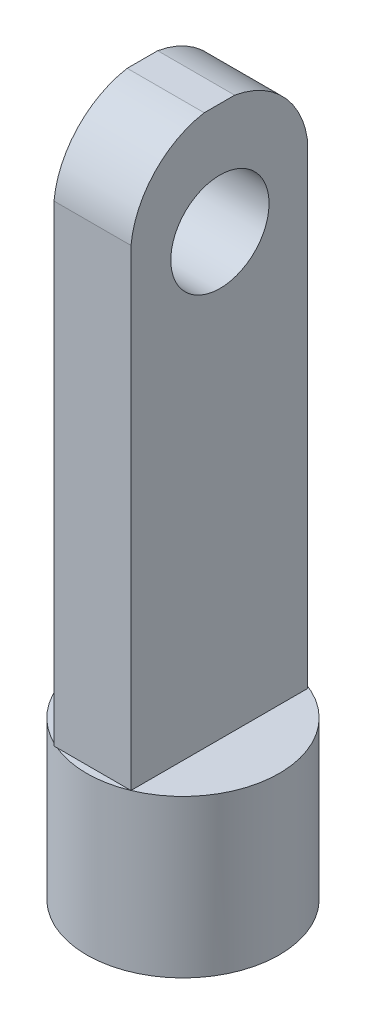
from build123d import *

# Parameters (mm, degrees)
SKETCH1_R           = 6.223
BOSS_EXTRUDE1_DEPTH = 10.16
SKETCH2_W           = 4.975932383
SKETCH2_H           = 11.405887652
BOSS_EXTRUDE2_DEPTH = 35.56
SKETCH3_R           = 3.302
CUT_EXTRUDE1_DEPTH  = 35.56
CUT_EXTRUDE3_DEPTH  = 35.56
BOSS_EXTRUDE4_START = -5.08
SKETCH5_R           = 3.302
SKETCH5_R_2         = 3.175
BOSS_EXTRUDE4_DEPTH = 5.08
SKETCH6_W           = 1.04504949
SKETCH6_H           = 8.332398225
CUT_EXTRUDE5_DEPTH  = 16.764


with BuildPart() as part:
    # Sketch1 → Boss-Extrude1 (new body)
    with BuildSketch(Plane(origin=(0, 0, 0), x_dir=(1, 0, 0), z_dir=(0, 1, 0))):
        with Locations(Location((0, 0, 0), (0, 0, 270))):
            Circle(SKETCH1_R)
    extrude(amount=BOSS_EXTRUDE1_DEPTH)

    # Sketch2 → Boss-Extrude2 (add)
    with BuildSketch(Plane(origin=(0, 10.16, 0), x_dir=(1, 0, 0), z_dir=(0, 1, 0))):
        with Locations((-0.101176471, -0.044139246)):
            Rectangle(SKETCH2_W, SKETCH2_H)
    extrude(amount=BOSS_EXTRUDE2_DEPTH)

    # Sketch3 → Cut-Extrude1 (cut)
    with BuildSketch(Plane.ZY.offset(2.589142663)):
        with Locations((0, 38.553154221)):
            Circle(SKETCH3_R)
    extrude(amount=-CUT_EXTRUDE1_DEPTH, mode=Mode.SUBTRACT)

    # Sketch4 → Cut-Extrude3 (cut)
    with BuildSketch(Plane.ZY.offset(2.589142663)):
        with BuildLine():
            Line((5.747083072, 45.72), (1.014771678, 45.72))
            ThreePointArc((1.014771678, 45.72), (4.22896457, 43.982939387), (5.747083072, 40.659728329))
            Line((5.747083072, 40.659728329), (5.747083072, 45.72))
        make_face()
        with BuildLine():
            Line((-0.953590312, 45.72), (-5.65880458, 45.72))
            Line((-5.65880458, 45.72), (-5.65880458, 40.876879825))
            ThreePointArc((-5.65880458, 40.876879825), (-4.092285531, 44.062144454), (-0.953590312, 45.72))
        make_face()
    extrude(amount=-CUT_EXTRUDE3_DEPTH, mode=Mode.SUBTRACT)

    # Sketch5 → Boss-Extrude4 (add)
    with BuildSketch(Plane(origin=(2.38678972, 0, 0), x_dir=(0, 0, -1), z_dir=(1, 0, 0)).offset(BOSS_EXTRUDE4_START)):
        with Locations((0, 38.553154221)):
            Circle(SKETCH5_R)
        with Locations((0, 38.553154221)):
            Circle(SKETCH5_R_2, mode=Mode.SUBTRACT)
    extrude(amount=BOSS_EXTRUDE4_DEPTH)

    # Sketch6 → Cut-Extrude5 (cut)
    with BuildSketch(Plane.XY.offset(5.747083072)):
        with Locations((-3.111667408, 38.626178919)):
            Rectangle(SKETCH6_W, SKETCH6_H)
    extrude(amount=-CUT_EXTRUDE5_DEPTH, mode=Mode.SUBTRACT)


solid = part.part
